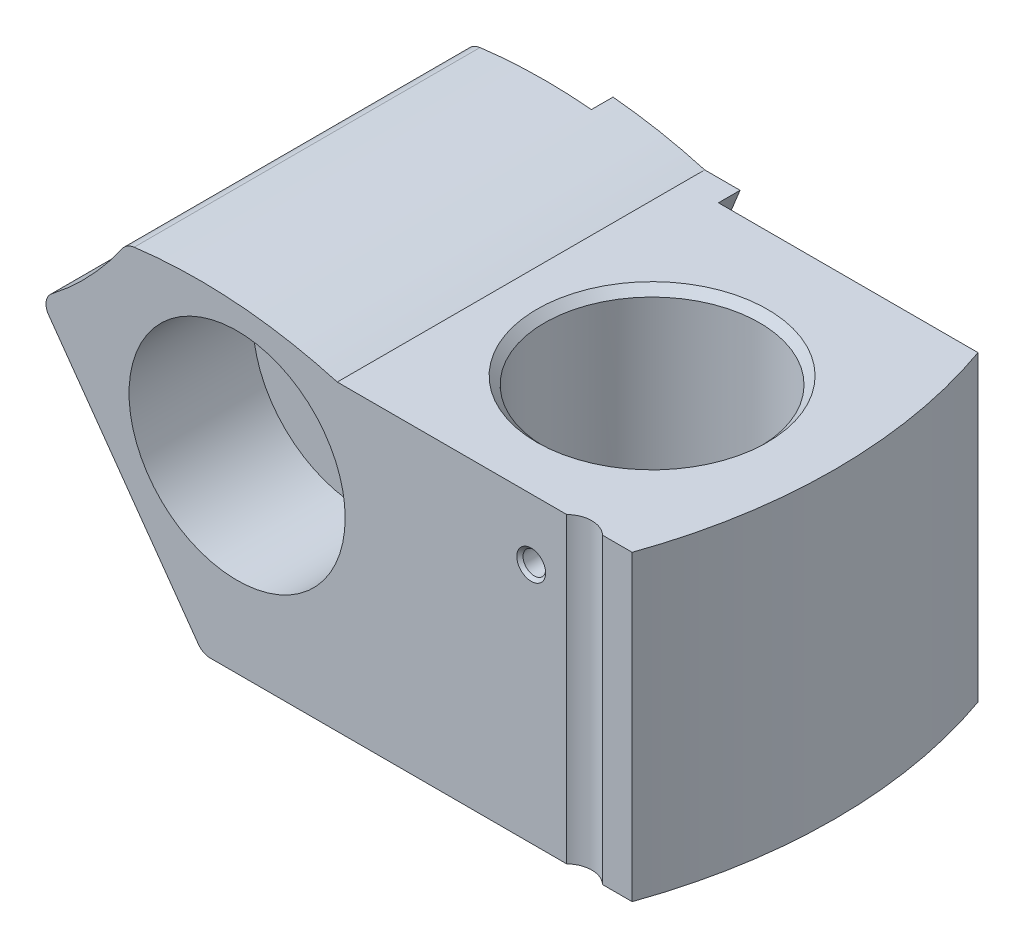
ISO-10303-21;
HEADER;
FILE_DESCRIPTION(('STEP AP214'),'2;1');
FILE_NAME('part.step','',(''),(''),'','','');
FILE_SCHEMA(('AUTOMOTIVE_DESIGN { 1 0 10303 214 1 1 1 1 }'));
ENDSEC;
DATA;
#1=APPLICATION_CONTEXT('core data for automotive mechanical design processes');
#2=APPLICATION_PROTOCOL_DEFINITION('international standard','automotive_design',2000,#1);
#3=PRODUCT_CONTEXT('',#1,'mechanical');
#4=PRODUCT('Part','Part','',(#3));
#5=PRODUCT_RELATED_PRODUCT_CATEGORY('part','',(#4));
#6=PRODUCT_DEFINITION_FORMATION('','',#4);
#7=PRODUCT_DEFINITION_CONTEXT('part definition',#1,'design');
#8=PRODUCT_DEFINITION('design','',#6,#7);
#9=PRODUCT_DEFINITION_SHAPE('','',#8);
#10=(LENGTH_UNIT() NAMED_UNIT(*) SI_UNIT(.MILLI.,.METRE.));
#11=(NAMED_UNIT(*) PLANE_ANGLE_UNIT() SI_UNIT($,.RADIAN.));
#12=(NAMED_UNIT(*) SI_UNIT($,.STERADIAN.) SOLID_ANGLE_UNIT());
#13=UNCERTAINTY_MEASURE_WITH_UNIT(LENGTH_MEASURE(1.E-05),#10,'distance_accuracy_value','');
#14=(GEOMETRIC_REPRESENTATION_CONTEXT(3) GLOBAL_UNCERTAINTY_ASSIGNED_CONTEXT((#13)) GLOBAL_UNIT_ASSIGNED_CONTEXT((#10,
#11,#12)) REPRESENTATION_CONTEXT('',''));
#15=CARTESIAN_POINT('',(0.,0.,0.));
#16=DIRECTION('',(0.,0.,1.));
#17=DIRECTION('',(1.,0.,0.));
#18=AXIS2_PLACEMENT_3D('',#15,#16,#17);
#19=CARTESIAN_POINT('',(30.6164,7.896,-25.5));
#20=DIRECTION('',(0.,1.,0.));
#21=DIRECTION('',(0.,0.,1.));
#22=AXIS2_PLACEMENT_3D('',#19,#20,#21);
#23=PLANE('',#22);
#24=CARTESIAN_POINT('',(-6.52329999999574,7.896,-12.));
#25=DIRECTION('',(0.,1.,0.));
#26=DIRECTION('',(0.,0.,1.));
#27=AXIS2_PLACEMENT_3D('',#24,#25,#26);
#28=CIRCLE('',#27,35.9999999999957);
#29=CARTESIAN_POINT('',(27.417825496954,7.896,-24.));
#30=VERTEX_POINT('',#29);
#31=CARTESIAN_POINT('',(27.417825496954,7.896,0.));
#32=VERTEX_POINT('',#31);
#33=EDGE_CURVE('E193',#30,#32,#28,.F.);
#34=ORIENTED_EDGE('',*,*,#33,.F.);
#35=DIRECTION('',(1.,0.,0.));
#36=VECTOR('',#35,1.);
#37=CARTESIAN_POINT('',(30.6164,7.896,-24.));
#38=LINE('',#37,#36);
#39=CARTESIAN_POINT('',(9.40695711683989,7.89599999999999,-24.));
#40=VERTEX_POINT('',#39);
#41=EDGE_CURVE('E226',#40,#30,#38,.T.);
#42=ORIENTED_EDGE('',*,*,#41,.F.);
#43=DIRECTION('',(0.,0.,1.));
#44=VECTOR('',#43,1.);
#45=CARTESIAN_POINT('',(9.40695711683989,7.89599999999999,-25.5));
#46=LINE('',#45,#44);
#47=CARTESIAN_POINT('',(9.40695711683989,7.89599999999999,-25.5));
#48=VERTEX_POINT('',#47);
#49=EDGE_CURVE('E206',#48,#40,#46,.T.);
#50=ORIENTED_EDGE('',*,*,#49,.F.);
#51=DIRECTION('',(-1.,0.,0.));
#52=VECTOR('',#51,1.);
#53=CARTESIAN_POINT('',(30.6164,7.896,-25.5));
#54=LINE('',#53,#52);
#55=CARTESIAN_POINT('',(6.9522692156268,7.896,-25.5));
#56=VERTEX_POINT('',#55);
#57=EDGE_CURVE('E237',#48,#56,#54,.T.);
#58=ORIENTED_EDGE('',*,*,#57,.T.);
#59=DIRECTION('',(0.,0.,1.));
#60=VECTOR('',#59,1.);
#61=CARTESIAN_POINT('',(6.9522692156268,7.896,-25.5));
#62=LINE('',#61,#60);
#63=CARTESIAN_POINT('',(6.9522692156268,7.896,0.));
#64=VERTEX_POINT('',#63);
#65=EDGE_CURVE('E271',#56,#64,#62,.T.);
#66=ORIENTED_EDGE('',*,*,#65,.T.);
#67=DIRECTION('',(-1.,0.,0.));
#68=VECTOR('',#67,1.);
#69=CARTESIAN_POINT('',(30.6164,7.896,0.));
#70=LINE('',#69,#68);
#71=CARTESIAN_POINT('',(22.8728100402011,7.896,0.));
#72=VERTEX_POINT('',#71);
#73=EDGE_CURVE('E258',#72,#64,#70,.T.);
#74=ORIENTED_EDGE('',*,*,#73,.F.);
#75=CARTESIAN_POINT('',(24.1178,7.896,1.3));
#76=DIRECTION('',(0.,1.,0.));
#77=DIRECTION('',(0.,0.,1.));
#78=AXIS2_PLACEMENT_3D('',#75,#76,#77);
#79=CIRCLE('',#78,1.8);
#80=CARTESIAN_POINT('',(25.3627899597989,7.896,0.));
#81=VERTEX_POINT('',#80);
#82=EDGE_CURVE('E231',#81,#72,#79,.T.);
#83=ORIENTED_EDGE('',*,*,#82,.F.);
#84=EDGE_CURVE('E259',#32,#81,#70,.T.);
#85=ORIENTED_EDGE('',*,*,#84,.F.);
#86=EDGE_LOOP('',(#34,#42,#50,#58,#66,#74,#83,#85));
#87=FACE_BOUND('',#86,.T.);
#88=CARTESIAN_POINT('',(17.5,7.896,-11.3));
#89=DIRECTION('',(0.,1.,0.));
#90=DIRECTION('',(0.,0.,1.));
#91=AXIS2_PLACEMENT_3D('',#88,#89,#90);
#92=CIRCLE('',#91,8.);
#93=CARTESIAN_POINT('',(17.5,7.896,-3.3));
#94=VERTEX_POINT('',#93);
#95=EDGE_CURVE('E295',#94,#94,#92,.T.);
#96=ORIENTED_EDGE('',*,*,#95,.F.);
#97=EDGE_LOOP('',(#96));
#98=FACE_BOUND('',#97,.T.);
#99=ADVANCED_FACE('F33',(#87,#98),#23,.T.);
#100=CARTESIAN_POINT('',(-1.8681244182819,-13.104,-25.5));
#101=DIRECTION('',(0.,-1.,0.));
#102=DIRECTION('',(0.,0.,-1.));
#103=AXIS2_PLACEMENT_3D('',#100,#101,#102);
#104=PLANE('',#103);
#105=CARTESIAN_POINT('',(-6.52329999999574,-13.104,-12.));
#106=DIRECTION('',(0.,-1.,0.));
#107=DIRECTION('',(0.,0.,-1.));
#108=AXIS2_PLACEMENT_3D('',#105,#106,#107);
#109=CIRCLE('',#108,35.9999999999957);
#110=CARTESIAN_POINT('',(27.417825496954,-13.104,0.));
#111=VERTEX_POINT('',#110);
#112=CARTESIAN_POINT('',(27.417825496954,-13.104,-24.));
#113=VERTEX_POINT('',#112);
#114=EDGE_CURVE('E58',#111,#113,#109,.F.);
#115=ORIENTED_EDGE('',*,*,#114,.F.);
#116=DIRECTION('',(1.,0.,0.));
#117=VECTOR('',#116,1.);
#118=CARTESIAN_POINT('',(-1.8681244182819,-13.104,0.));
#119=LINE('',#118,#117);
#120=CARTESIAN_POINT('',(25.3627899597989,-13.104,0.));
#121=VERTEX_POINT('',#120);
#122=EDGE_CURVE('E254',#121,#111,#119,.T.);
#123=ORIENTED_EDGE('',*,*,#122,.F.);
#124=CARTESIAN_POINT('',(24.1178,-13.104,1.3));
#125=DIRECTION('',(0.,-1.,0.));
#126=DIRECTION('',(0.,0.,-1.));
#127=AXIS2_PLACEMENT_3D('',#124,#125,#126);
#128=CIRCLE('',#127,1.8);
#129=CARTESIAN_POINT('',(22.8728100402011,-13.104,0.));
#130=VERTEX_POINT('',#129);
#131=EDGE_CURVE('E229',#130,#121,#128,.T.);
#132=ORIENTED_EDGE('',*,*,#131,.F.);
#133=CARTESIAN_POINT('',(-1.8681244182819,-13.104,0.));
#134=VERTEX_POINT('',#133);
#135=EDGE_CURVE('E255',#134,#130,#119,.T.);
#136=ORIENTED_EDGE('',*,*,#135,.F.);
#137=DIRECTION('',(0.,0.,1.));
#138=VECTOR('',#137,1.);
#139=CARTESIAN_POINT('',(-1.8681244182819,-13.104,-25.5));
#140=LINE('',#139,#138);
#141=CARTESIAN_POINT('',(-1.8681244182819,-13.104,-24.));
#142=VERTEX_POINT('',#141);
#143=EDGE_CURVE('E273',#142,#134,#140,.T.);
#144=ORIENTED_EDGE('',*,*,#143,.F.);
#145=DIRECTION('',(-1.,0.,0.));
#146=VECTOR('',#145,1.);
#147=CARTESIAN_POINT('',(-1.8681244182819,-13.104,-24.));
#148=LINE('',#147,#146);
#149=EDGE_CURVE('E224',#113,#142,#148,.T.);
#150=ORIENTED_EDGE('',*,*,#149,.F.);
#151=EDGE_LOOP('',(#115,#123,#132,#136,#144,#150));
#152=FACE_BOUND('',#151,.T.);
#153=CARTESIAN_POINT('',(17.5,-13.104,-11.3));
#154=DIRECTION('',(0.,-1.,0.));
#155=DIRECTION('',(0.,0.,-1.));
#156=AXIS2_PLACEMENT_3D('',#153,#154,#155);
#157=CIRCLE('',#156,7.99);
#158=CARTESIAN_POINT('',(17.5,-13.104,-19.29));
#159=VERTEX_POINT('',#158);
#160=EDGE_CURVE('E37',#159,#159,#157,.F.);
#161=ORIENTED_EDGE('',*,*,#160,.T.);
#162=EDGE_LOOP('',(#161));
#163=FACE_BOUND('',#162,.T.);
#164=ADVANCED_FACE('F321',(#152,#163),#104,.T.);
#165=CARTESIAN_POINT('',(20.4121,3.646,0.));
#166=DIRECTION('',(0.,0.,-1.));
#167=DIRECTION('',(-1.,0.,0.));
#168=AXIS2_PLACEMENT_3D('',#165,#166,#167);
#169=CYLINDRICAL_SURFACE('',#168,0.783499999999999);
#170=CARTESIAN_POINT('',(20.4121,3.646,-0.2165));
#171=DIRECTION('',(0.,0.,-1.));
#172=DIRECTION('',(-1.,0.,0.));
#173=AXIS2_PLACEMENT_3D('',#170,#171,#172);
#174=CIRCLE('',#173,0.783499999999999);
#175=CARTESIAN_POINT('',(19.6286,3.646,-0.2165));
#176=VERTEX_POINT('',#175);
#177=EDGE_CURVE('E182',#176,#176,#174,.T.);
#178=ORIENTED_EDGE('',*,*,#177,.F.);
#179=EDGE_LOOP('',(#178));
#180=FACE_BOUND('',#179,.T.);
#181=CARTESIAN_POINT('',(19.6286,3.646,-4.15169360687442));
#182=CARTESIAN_POINT('',(19.6286020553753,3.68851259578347,-4.15169387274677));
#183=CARTESIAN_POINT('',(19.6320740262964,3.73105649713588,-4.15272524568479));
#184=CARTESIAN_POINT('',(19.6458506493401,3.81495458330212,-4.15684965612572));
#185=CARTESIAN_POINT('',(19.656163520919,3.85630727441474,-4.15994517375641));
#186=CARTESIAN_POINT('',(19.6832453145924,3.9365761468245,-4.16817968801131));
#187=CARTESIAN_POINT('',(19.7000072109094,3.97549492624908,-4.17331646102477));
#188=CARTESIAN_POINT('',(19.7393978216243,4.04987530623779,-4.18559608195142));
#189=CARTESIAN_POINT('',(19.7620252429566,4.08533766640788,-4.19273848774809));
#190=CARTESIAN_POINT('',(19.8127179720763,4.1523615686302,-4.20907100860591));
#191=CARTESIAN_POINT('',(19.840851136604,4.18386542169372,-4.21828691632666));
#192=CARTESIAN_POINT('',(19.9014304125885,4.2416871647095,-4.23859975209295));
#193=CARTESIAN_POINT('',(19.9338772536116,4.26800417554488,-4.24969699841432));
#194=CARTESIAN_POINT('',(20.003410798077,4.31584673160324,-4.27407916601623));
#195=CARTESIAN_POINT('',(20.0406288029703,4.33714635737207,-4.28743233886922));
#196=CARTESIAN_POINT('',(20.1175094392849,4.37325088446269,-4.31576449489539));
#197=CARTESIAN_POINT('',(20.1571726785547,4.38805416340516,-4.33074388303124));
#198=CARTESIAN_POINT('',(20.2402355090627,4.41170702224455,-4.36296689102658));
#199=CARTESIAN_POINT('',(20.2837176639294,4.42015533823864,-4.38029185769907));
#200=CARTESIAN_POINT('',(20.3710270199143,4.429655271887,-4.41605820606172));
#201=CARTESIAN_POINT('',(20.4148543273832,4.43070451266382,-4.43449994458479));
#202=CARTESIAN_POINT('',(20.5046479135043,4.42539734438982,-4.47329820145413));
#203=CARTESIAN_POINT('',(20.5505654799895,4.4185497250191,-4.49370090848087));
#204=CARTESIAN_POINT('',(20.640418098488,4.39691960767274,-4.53468860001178));
#205=CARTESIAN_POINT('',(20.6843524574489,4.3821343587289,-4.55527364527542));
#206=CARTESIAN_POINT('',(20.7708317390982,4.34421265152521,-4.59677151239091));
#207=CARTESIAN_POINT('',(20.8132508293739,4.32076585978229,-4.61766451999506));
#208=CARTESIAN_POINT('',(20.8935044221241,4.26606433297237,-4.65805977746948));
#209=CARTESIAN_POINT('',(20.9313384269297,4.23480875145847,-4.67756187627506));
#210=CARTESIAN_POINT('',(21.0000119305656,4.16611384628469,-4.71360500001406));
#211=CARTESIAN_POINT('',(21.0310286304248,4.1288905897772,-4.73021784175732));
#212=CARTESIAN_POINT('',(21.086108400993,4.04843581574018,-4.76011971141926));
#213=CARTESIAN_POINT('',(21.1101782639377,4.00521022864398,-4.77341198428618));
#214=CARTESIAN_POINT('',(21.1477754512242,3.91914247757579,-4.7943586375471));
#215=CARTESIAN_POINT('',(21.1621807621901,3.87679806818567,-4.80247728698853));
#216=CARTESIAN_POINT('',(21.1836041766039,3.78972601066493,-4.81459805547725));
#217=CARTESIAN_POINT('',(21.1906299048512,3.74500087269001,-4.81860442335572));
#218=CARTESIAN_POINT('',(21.1964802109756,3.66026673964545,-4.82193980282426));
#219=CARTESIAN_POINT('',(21.1961877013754,3.62033579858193,-4.82177237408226));
#220=CARTESIAN_POINT('',(21.1895675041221,3.5411485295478,-4.81799965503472));
#221=CARTESIAN_POINT('',(21.1832408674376,3.50189208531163,-4.81439496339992));
#222=CARTESIAN_POINT('',(21.1651714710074,3.42642230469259,-4.80416731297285));
#223=CARTESIAN_POINT('',(21.1536078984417,3.3901518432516,-4.79764429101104));
#224=CARTESIAN_POINT('',(21.1256213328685,3.32014467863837,-4.78199815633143));
#225=CARTESIAN_POINT('',(21.1091973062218,3.28640851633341,-4.77287449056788));
#226=CARTESIAN_POINT('',(21.0707707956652,3.21985068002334,-4.7517689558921));
#227=CARTESIAN_POINT('',(21.0484586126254,3.18725778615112,-4.73963187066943));
#228=CARTESIAN_POINT('',(20.999664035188,3.12622172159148,-4.71347282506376));
#229=CARTESIAN_POINT('',(20.9731797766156,3.09778041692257,-4.69945002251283));
#230=CARTESIAN_POINT('',(20.9133635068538,3.04229222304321,-4.66830057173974));
#231=CARTESIAN_POINT('',(20.8795915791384,3.01581519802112,-4.65100317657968));
#232=CARTESIAN_POINT('',(20.8085812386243,2.96888224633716,-4.61538390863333));
#233=CARTESIAN_POINT('',(20.7713411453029,2.94842925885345,-4.59706154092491));
#234=CARTESIAN_POINT('',(20.6902954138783,2.91207432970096,-4.55808218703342));
#235=CARTESIAN_POINT('',(20.646207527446,2.89684931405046,-4.53737768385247));
#236=CARTESIAN_POINT('',(20.5559591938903,2.87441725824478,-4.49611882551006));
#237=CARTESIAN_POINT('',(20.5097981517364,2.86721253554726,-4.47556451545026));
#238=CARTESIAN_POINT('',(20.4149916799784,2.86101856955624,-4.43452104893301));
#239=CARTESIAN_POINT('',(20.3663152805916,2.86231878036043,-4.41405817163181));
#240=CARTESIAN_POINT('',(20.2694808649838,2.87404855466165,-4.37454469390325));
#241=CARTESIAN_POINT('',(20.2213227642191,2.88447660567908,-4.35549386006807));
#242=CARTESIAN_POINT('',(20.1289026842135,2.91392356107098,-4.31999609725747));
#243=CARTESIAN_POINT('',(20.0845624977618,2.93261090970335,-4.30347897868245));
#244=CARTESIAN_POINT('',(19.9994883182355,2.97820547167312,-4.27263724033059));
#245=CARTESIAN_POINT('',(19.9587526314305,3.0051087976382,-4.25831158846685));
#246=CARTESIAN_POINT('',(19.8851475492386,3.06438870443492,-4.23305534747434));
#247=CARTESIAN_POINT('',(19.8519301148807,3.09626276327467,-4.2219592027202));
#248=CARTESIAN_POINT('',(19.7913118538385,3.16577261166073,-4.2021036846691));
#249=CARTESIAN_POINT('',(19.7639104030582,3.20340778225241,-4.19334406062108));
#250=CARTESIAN_POINT('',(19.7174624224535,3.28093423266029,-4.17871903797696));
#251=CARTESIAN_POINT('',(19.6980186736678,3.3205618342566,-4.17271349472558));
#252=CARTESIAN_POINT('',(19.6660259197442,3.40272452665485,-4.16292518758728));
#253=CARTESIAN_POINT('',(19.6534665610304,3.44525514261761,-4.15913908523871));
#254=CARTESIAN_POINT('',(19.639274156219,3.51442618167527,-4.15487884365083));
#255=CARTESIAN_POINT('',(19.6352775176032,3.54056204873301,-4.15368486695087));
#256=CARTESIAN_POINT('',(19.6299398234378,3.59312791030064,-4.15209217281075));
#257=CARTESIAN_POINT('',(19.628598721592,3.61955789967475,-4.15169344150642));
#258=CARTESIAN_POINT('',(19.6286,3.646,-4.15169360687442));
#259=B_SPLINE_CURVE_WITH_KNOTS('',3,(#181,#182,#183,#184,#185,#186,#187,#188,#189,#190,#191,
#192,#193,#194,#195,#196,#197,#198,#199,#200,#201,#202,#203,#204,#205,#206,#207,#208,#209,#210,
#211,#212,#213,#214,#215,#216,#217,#218,#219,#220,#221,#222,#223,#224,#225,#226,#227,#228,#229,
#230,#231,#232,#233,#234,#235,#236,#237,#238,#239,#240,#241,#242,#243,#244,#245,#246,#247,#248,
#249,#250,#251,#252,#253,#254,#255,#256,#257,#258),.UNSPECIFIED.,.T.,.F.,(4,2,2,2,2,2,2,2,2,2,2,
2,2,2,2,2,2,2,2,2,2,2,2,2,2,2,2,2,2,2,2,2,2,2,2,2,2,2,4),(0.,0.127439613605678,
0.255032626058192,0.382487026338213,0.509913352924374,0.639022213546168,0.768152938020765,
0.902301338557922,1.03648322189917,1.17855508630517,1.32067258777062,1.47212965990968,
1.62363925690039,1.78120800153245,1.93879383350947,2.09160473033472,2.24426570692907,
2.37985368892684,2.51530143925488,2.63449660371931,2.75367101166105,2.8690442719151,
2.98444208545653,3.10790666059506,3.23142655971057,3.36966304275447,3.50796686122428,
3.66037650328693,3.81283017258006,3.97049876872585,4.1281412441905,4.27996074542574,
4.43170852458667,4.57303894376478,4.71435418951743,4.84734112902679,4.98012751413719,
5.05939413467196,5.13865937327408),.UNSPECIFIED.);
#260=CARTESIAN_POINT('',(19.6286,3.646,-4.15169360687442));
#261=VERTEX_POINT('',#260);
#262=EDGE_CURVE('E289',#261,#261,#259,.T.);
#263=ORIENTED_EDGE('',*,*,#262,.T.);
#264=EDGE_LOOP('',(#263));
#265=FACE_BOUND('',#264,.T.);
#266=ADVANCED_FACE('F296',(#180,#265),#169,.F.);
#267=CARTESIAN_POINT('',(-27.279800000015,21.8475000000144,0.));
#268=DIRECTION('',(0.,0.,-1.));
#269=DIRECTION('',(-1.,0.,0.));
#270=AXIS2_PLACEMENT_3D('',#267,#268,#269);
#271=PLANE('',#270);
#272=CARTESIAN_POINT('',(0.,0.,0.));
#273=DIRECTION('',(0.,0.,1.));
#274=DIRECTION('',(1.,0.,0.));
#275=AXIS2_PLACEMENT_3D('',#272,#273,#274);
#276=CIRCLE('',#275,7.5);
#277=CARTESIAN_POINT('',(7.5,0.,0.));
#278=VERTEX_POINT('',#277);
#279=EDGE_CURVE('E423',#278,#278,#276,.T.);
#280=ORIENTED_EDGE('',*,*,#279,.F.);
#281=EDGE_LOOP('',(#280));
#282=FACE_BOUND('',#281,.T.);
#283=ORIENTED_EDGE('',*,*,#135,.T.);
#284=DIRECTION('',(0.,1.,0.));
#285=VECTOR('',#284,1.);
#286=CARTESIAN_POINT('',(22.8728100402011,-15.,0.));
#287=LINE('',#286,#285);
#288=EDGE_CURVE('E282',#130,#72,#287,.T.);
#289=ORIENTED_EDGE('',*,*,#288,.T.);
#290=ORIENTED_EDGE('',*,*,#73,.T.);
#291=CARTESIAN_POINT('',(-2.65469999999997,-25.7597000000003,0.));
#292=DIRECTION('',(0.,0.,1.));
#293=DIRECTION('',(1.,0.,0.));
#294=AXIS2_PLACEMENT_3D('',#291,#292,#293);
#295=CIRCLE('',#294,35.0000000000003);
#296=CARTESIAN_POINT('',(-7.1442578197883,8.9511609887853,0.));
#297=VERTEX_POINT('',#296);
#298=EDGE_CURVE('E261',#64,#297,#295,.T.);
#299=ORIENTED_EDGE('',*,*,#298,.T.);
#300=CARTESIAN_POINT('',(-6.9903294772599,7.76107440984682,0.));
#301=DIRECTION('',(0.,0.,1.));
#302=DIRECTION('',(1.,0.,0.));
#303=AXIS2_PLACEMENT_3D('',#300,#301,#302);
#304=CIRCLE('',#303,1.20000000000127);
#305=CARTESIAN_POINT('',(-7.9760527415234,8.4454351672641,0.));
#306=VERTEX_POINT('',#305);
#307=EDGE_CURVE('E238',#297,#306,#304,.T.);
#308=ORIENTED_EDGE('',*,*,#307,.T.);
#309=CARTESIAN_POINT('',(-27.279800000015,21.8475000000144,0.));
#310=DIRECTION('',(0.,0.,-1.));
#311=DIRECTION('',(-1.,0.,0.));
#312=AXIS2_PLACEMENT_3D('',#309,#310,#311);
#313=CIRCLE('',#312,23.5000000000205);
#314=CARTESIAN_POINT('',(-12.875283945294,3.2797883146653,0.));
#315=VERTEX_POINT('',#314);
#316=EDGE_CURVE('E233',#306,#315,#313,.T.);
#317=ORIENTED_EDGE('',*,*,#316,.T.);
#318=CARTESIAN_POINT('',(-12.2623258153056,2.48967292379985,0.));
#319=DIRECTION('',(0.,0.,1.));
#320=DIRECTION('',(1.,0.,0.));
#321=AXIS2_PLACEMENT_3D('',#318,#319,#320);
#322=CIRCLE('',#321,1.00000000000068);
#323=CARTESIAN_POINT('',(-13.076846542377,1.9095384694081,0.));
#324=VERTEX_POINT('',#323);
#325=EDGE_CURVE('E245',#315,#324,#322,.T.);
#326=ORIENTED_EDGE('',*,*,#325,.T.);
#327=DIRECTION('',(0.580134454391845,-0.814520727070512,0.));
#328=VECTOR('',#327,1.);
#329=CARTESIAN_POINT('',(-13.076846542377,1.9095384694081,0.));
#330=LINE('',#329,#328);
#331=CARTESIAN_POINT('',(-2.6826451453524,-12.684134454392,0.));
#332=VERTEX_POINT('',#331);
#333=EDGE_CURVE('E248',#324,#332,#330,.T.);
#334=ORIENTED_EDGE('',*,*,#333,.T.);
#335=CARTESIAN_POINT('',(-1.86812441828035,-12.1039999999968,0.));
#336=DIRECTION('',(0.,0.,1.));
#337=DIRECTION('',(1.,0.,0.));
#338=AXIS2_PLACEMENT_3D('',#335,#336,#337);
#339=CIRCLE('',#338,1.0000000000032);
#340=EDGE_CURVE('E251',#332,#134,#339,.T.);
#341=ORIENTED_EDGE('',*,*,#340,.T.);
#342=EDGE_LOOP('',(#283,#289,#290,#299,#308,#317,#326,#334,#341));
#343=FACE_BOUND('',#342,.T.);
#344=CARTESIAN_POINT('',(20.4121,3.646,0.));
#345=DIRECTION('',(0.,0.,-1.));
#346=DIRECTION('',(-1.,0.,0.));
#347=AXIS2_PLACEMENT_3D('',#344,#345,#346);
#348=CIRCLE('',#347,1.);
#349=CARTESIAN_POINT('',(19.4121,3.646,0.));
#350=VERTEX_POINT('',#349);
#351=EDGE_CURVE('E435',#350,#350,#348,.T.);
#352=ORIENTED_EDGE('',*,*,#351,.T.);
#353=EDGE_LOOP('',(#352));
#354=FACE_BOUND('',#353,.T.);
#355=ADVANCED_FACE('F352',(#282,#343,#354),#271,.F.);
#356=CARTESIAN_POINT('',(-27.279800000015,21.8475000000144,-25.5));
#357=DIRECTION('',(0.,0.,-1.));
#358=DIRECTION('',(-1.,0.,0.));
#359=AXIS2_PLACEMENT_3D('',#356,#357,#358);
#360=PLANE('',#359);
#361=CARTESIAN_POINT('',(-27.279800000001,21.8475000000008,-25.5));
#362=DIRECTION('',(0.,0.,1.));
#363=DIRECTION('',(1.,0.,0.));
#364=AXIS2_PLACEMENT_3D('',#361,#362,#363);
#365=CIRCLE('',#364,39.2500000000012);
#366=CARTESIAN_POINT('',(4.21532506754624,-1.57513001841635,-25.5));
#367=VERTEX_POINT('',#366);
#368=EDGE_CURVE('E181',#367,#48,#365,.T.);
#369=ORIENTED_EDGE('',*,*,#368,.F.);
#370=CARTESIAN_POINT('',(0.,0.,-25.5));
#371=DIRECTION('',(0.,0.,1.));
#372=DIRECTION('',(1.,0.,0.));
#373=AXIS2_PLACEMENT_3D('',#370,#371,#372);
#374=CIRCLE('',#373,4.5);
#375=CARTESIAN_POINT('',(-2.59945310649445,3.67326061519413,-25.5));
#376=VERTEX_POINT('',#375);
#377=EDGE_CURVE('E165',#367,#376,#374,.T.);
#378=ORIENTED_EDGE('',*,*,#377,.T.);
#379=CARTESIAN_POINT('',(-27.279800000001,21.8475000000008,-25.5));
#380=DIRECTION('',(0.,0.,-1.));
#381=DIRECTION('',(-1.,0.,0.));
#382=AXIS2_PLACEMENT_3D('',#379,#380,#381);
#383=CIRCLE('',#382,30.6500000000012);
#384=CARTESIAN_POINT('',(0.588831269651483,9.08968313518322,-25.5));
#385=VERTEX_POINT('',#384);
#386=EDGE_CURVE('E178',#385,#376,#383,.T.);
#387=ORIENTED_EDGE('',*,*,#386,.F.);
#388=CARTESIAN_POINT('',(-2.65469999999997,-25.7597000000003,-25.5));
#389=DIRECTION('',(0.,0.,1.));
#390=DIRECTION('',(1.,0.,0.));
#391=AXIS2_PLACEMENT_3D('',#388,#389,#390);
#392=CIRCLE('',#391,35.0000000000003);
#393=EDGE_CURVE('E240',#56,#385,#392,.T.);
#394=ORIENTED_EDGE('',*,*,#393,.F.);
#395=ORIENTED_EDGE('',*,*,#57,.F.);
#396=EDGE_LOOP('',(#369,#378,#387,#394,#395));
#397=FACE_BOUND('',#396,.T.);
#398=ADVANCED_FACE('F176',(#397),#360,.T.);
#399=CARTESIAN_POINT('',(-4.15244948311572,1.7341174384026,-25.5));
#400=VERTEX_POINT('',#399);
#401=CARTESIAN_POINT('',(-9.4971301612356,-3.1164570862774,-25.5));
#402=VERTEX_POINT('',#401);
#403=EDGE_CURVE('E187',#400,#402,#383,.T.);
#404=ORIENTED_EDGE('',*,*,#403,.F.);
#405=CARTESIAN_POINT('',(2.45804371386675,-3.7693528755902,-25.5));
#406=VERTEX_POINT('',#405);
#407=EDGE_CURVE('E50',#400,#406,#374,.T.);
#408=ORIENTED_EDGE('',*,*,#407,.T.);
#409=CARTESIAN_POINT('',(-4.50797384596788,-10.1213353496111,-25.5));
#410=VERTEX_POINT('',#409);
#411=EDGE_CURVE('E189',#410,#406,#365,.T.);
#412=ORIENTED_EDGE('',*,*,#411,.F.);
#413=DIRECTION('',(0.580134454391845,-0.814520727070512,0.));
#414=VECTOR('',#413,1.);
#415=CARTESIAN_POINT('',(-13.076846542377,1.9095384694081,-25.5));
#416=LINE('',#415,#414);
#417=EDGE_CURVE('E234',#402,#410,#416,.T.);
#418=ORIENTED_EDGE('',*,*,#417,.F.);
#419=EDGE_LOOP('',(#404,#408,#412,#418));
#420=FACE_BOUND('',#419,.T.);
#421=ADVANCED_FACE('F407',(#420),#360,.T.);
#422=CARTESIAN_POINT('',(-27.279800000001,21.8475000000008,-25.5));
#423=DIRECTION('',(0.,0.,1.));
#424=DIRECTION('',(1.,0.,0.));
#425=AXIS2_PLACEMENT_3D('',#422,#423,#424);
#426=CYLINDRICAL_SURFACE('',#425,39.2500000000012);
#427=CARTESIAN_POINT('',(-27.279800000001,21.8475000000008,-24.));
#428=DIRECTION('',(0.,0.,1.));
#429=DIRECTION('',(1.,0.,0.));
#430=AXIS2_PLACEMENT_3D('',#427,#428,#429);
#431=CIRCLE('',#430,39.2500000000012);
#432=CARTESIAN_POINT('',(4.21532506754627,-1.57513001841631,-24.));
#433=VERTEX_POINT('',#432);
#434=EDGE_CURVE('E200',#433,#40,#431,.T.);
#435=ORIENTED_EDGE('',*,*,#434,.F.);
#436=DIRECTION('',(0.,0.,1.));
#437=VECTOR('',#436,1.);
#438=CARTESIAN_POINT('',(4.21532506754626,-1.57513001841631,-17.05));
#439=LINE('',#438,#437);
#440=EDGE_CURVE('E389',#433,#367,#439,.F.);
#441=ORIENTED_EDGE('',*,*,#440,.T.);
#442=ORIENTED_EDGE('',*,*,#368,.T.);
#443=ORIENTED_EDGE('',*,*,#49,.T.);
#444=EDGE_LOOP('',(#435,#441,#442,#443));
#445=FACE_BOUND('',#444,.T.);
#446=ADVANCED_FACE('F388',(#445),#426,.T.);
#447=ORIENTED_EDGE('',*,*,#411,.T.);
#448=DIRECTION('',(0.,0.,1.));
#449=VECTOR('',#448,1.);
#450=CARTESIAN_POINT('',(2.45804371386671,-3.76935287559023,-17.05));
#451=LINE('',#450,#449);
#452=CARTESIAN_POINT('',(2.45804371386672,-3.76935287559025,-24.));
#453=VERTEX_POINT('',#452);
#454=EDGE_CURVE('E392',#406,#453,#451,.T.);
#455=ORIENTED_EDGE('',*,*,#454,.T.);
#456=CARTESIAN_POINT('',(-4.5079738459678,-10.121335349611,-24.));
#457=VERTEX_POINT('',#456);
#458=EDGE_CURVE('E191',#457,#453,#431,.T.);
#459=ORIENTED_EDGE('',*,*,#458,.F.);
#460=DIRECTION('',(0.,0.,1.));
#461=VECTOR('',#460,1.);
#462=CARTESIAN_POINT('',(-4.5079738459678,-10.121335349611,-25.5));
#463=LINE('',#462,#461);
#464=EDGE_CURVE('E209',#410,#457,#463,.T.);
#465=ORIENTED_EDGE('',*,*,#464,.F.);
#466=EDGE_LOOP('',(#447,#455,#459,#465));
#467=FACE_BOUND('',#466,.T.);
#468=ADVANCED_FACE('F409',(#467),#426,.T.);
#469=CARTESIAN_POINT('',(-15.,-15.,-24.));
#470=DIRECTION('',(0.,0.,1.));
#471=DIRECTION('',(1.,0.,0.));
#472=AXIS2_PLACEMENT_3D('',#469,#470,#471);
#473=PLANE('',#472);
#474=CARTESIAN_POINT('',(0.,0.,-24.));
#475=DIRECTION('',(0.,0.,1.));
#476=DIRECTION('',(1.,0.,0.));
#477=AXIS2_PLACEMENT_3D('',#474,#475,#476);
#478=CIRCLE('',#477,4.5);
#479=EDGE_CURVE('E397',#433,#453,#478,.F.);
#480=ORIENTED_EDGE('',*,*,#479,.F.);
#481=ORIENTED_EDGE('',*,*,#434,.T.);
#482=ORIENTED_EDGE('',*,*,#41,.T.);
#483=DIRECTION('',(0.,1.,0.));
#484=VECTOR('',#483,1.);
#485=CARTESIAN_POINT('',(27.417825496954,-15.,-24.));
#486=LINE('',#485,#484);
#487=EDGE_CURVE('E287',#30,#113,#486,.F.);
#488=ORIENTED_EDGE('',*,*,#487,.T.);
#489=ORIENTED_EDGE('',*,*,#149,.T.);
#490=CARTESIAN_POINT('',(-1.86812441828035,-12.1039999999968,-24.));
#491=DIRECTION('',(0.,0.,1.));
#492=DIRECTION('',(1.,0.,0.));
#493=AXIS2_PLACEMENT_3D('',#490,#491,#492);
#494=CIRCLE('',#493,1.0000000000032);
#495=CARTESIAN_POINT('',(-2.6826451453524,-12.684134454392,-24.));
#496=VERTEX_POINT('',#495);
#497=EDGE_CURVE('E222',#142,#496,#494,.F.);
#498=ORIENTED_EDGE('',*,*,#497,.T.);
#499=DIRECTION('',(-0.580134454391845,0.814520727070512,0.));
#500=VECTOR('',#499,1.);
#501=CARTESIAN_POINT('',(-13.076846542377,1.9095384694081,-24.));
#502=LINE('',#501,#500);
#503=EDGE_CURVE('E216',#496,#457,#502,.T.);
#504=ORIENTED_EDGE('',*,*,#503,.T.);
#505=ORIENTED_EDGE('',*,*,#458,.T.);
#506=EDGE_LOOP('',(#480,#481,#482,#488,#489,#498,#504,#505));
#507=FACE_BOUND('',#506,.T.);
#508=ADVANCED_FACE('F422',(#507),#473,.F.);
#509=CARTESIAN_POINT('',(0.,0.,-24.));
#510=DIRECTION('',(0.,0.,1.));
#511=DIRECTION('',(1.,0.,0.));
#512=AXIS2_PLACEMENT_3D('',#509,#510,#511);
#513=CIRCLE('',#512,4.5);
#514=CARTESIAN_POINT('',(-4.15244948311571,1.73411743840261,-24.));
#515=VERTEX_POINT('',#514);
#516=CARTESIAN_POINT('',(-2.59945310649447,3.6732606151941,-24.));
#517=VERTEX_POINT('',#516);
#518=EDGE_CURVE('E168',#515,#517,#513,.F.);
#519=ORIENTED_EDGE('',*,*,#518,.F.);
#520=CARTESIAN_POINT('',(-27.279800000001,21.8475000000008,-24.));
#521=DIRECTION('',(0.,0.,-1.));
#522=DIRECTION('',(-1.,0.,0.));
#523=AXIS2_PLACEMENT_3D('',#520,#521,#522);
#524=CIRCLE('',#523,30.6500000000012);
#525=CARTESIAN_POINT('',(-9.4971301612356,-3.1164570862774,-24.));
#526=VERTEX_POINT('',#525);
#527=EDGE_CURVE('E201',#515,#526,#524,.T.);
#528=ORIENTED_EDGE('',*,*,#527,.T.);
#529=CARTESIAN_POINT('',(-13.076846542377,1.9095384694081,-24.));
#530=VERTEX_POINT('',#529);
#531=EDGE_CURVE('E205',#526,#530,#502,.T.);
#532=ORIENTED_EDGE('',*,*,#531,.T.);
#533=CARTESIAN_POINT('',(-12.2623258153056,2.48967292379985,-24.));
#534=DIRECTION('',(0.,0.,1.));
#535=DIRECTION('',(1.,0.,0.));
#536=AXIS2_PLACEMENT_3D('',#533,#534,#535);
#537=CIRCLE('',#536,1.00000000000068);
#538=CARTESIAN_POINT('',(-12.875283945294,3.2797883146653,-24.));
#539=VERTEX_POINT('',#538);
#540=EDGE_CURVE('E285',#530,#539,#537,.F.);
#541=ORIENTED_EDGE('',*,*,#540,.T.);
#542=CARTESIAN_POINT('',(-27.279800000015,21.8475000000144,-24.));
#543=DIRECTION('',(0.,0.,1.));
#544=DIRECTION('',(1.,0.,0.));
#545=AXIS2_PLACEMENT_3D('',#542,#543,#544);
#546=CIRCLE('',#545,23.5000000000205);
#547=CARTESIAN_POINT('',(-7.9760527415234,8.4454351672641,-24.));
#548=VERTEX_POINT('',#547);
#549=EDGE_CURVE('E215',#539,#548,#546,.T.);
#550=ORIENTED_EDGE('',*,*,#549,.T.);
#551=CARTESIAN_POINT('',(-6.9903294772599,7.76107440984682,-24.));
#552=DIRECTION('',(0.,0.,1.));
#553=DIRECTION('',(1.,0.,0.));
#554=AXIS2_PLACEMENT_3D('',#551,#552,#553);
#555=CIRCLE('',#554,1.20000000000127);
#556=CARTESIAN_POINT('',(-7.1442578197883,8.9511609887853,-24.));
#557=VERTEX_POINT('',#556);
#558=EDGE_CURVE('E218',#548,#557,#555,.F.);
#559=ORIENTED_EDGE('',*,*,#558,.T.);
#560=CARTESIAN_POINT('',(-2.65469999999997,-25.7597000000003,-24.));
#561=DIRECTION('',(0.,0.,1.));
#562=DIRECTION('',(1.,0.,0.));
#563=AXIS2_PLACEMENT_3D('',#560,#561,#562);
#564=CIRCLE('',#563,35.0000000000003);
#565=CARTESIAN_POINT('',(0.58883126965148,9.0896831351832,-24.));
#566=VERTEX_POINT('',#565);
#567=EDGE_CURVE('E220',#557,#566,#564,.F.);
#568=ORIENTED_EDGE('',*,*,#567,.T.);
#569=EDGE_CURVE('E198',#566,#517,#524,.T.);
#570=ORIENTED_EDGE('',*,*,#569,.T.);
#571=EDGE_LOOP('',(#519,#528,#532,#541,#550,#559,#568,#570));
#572=FACE_BOUND('',#571,.T.);
#573=ADVANCED_FACE('F372',(#572),#473,.F.);
#574=CARTESIAN_POINT('',(-27.279800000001,21.8475000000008,-25.5));
#575=DIRECTION('',(0.,0.,1.));
#576=DIRECTION('',(1.,0.,0.));
#577=AXIS2_PLACEMENT_3D('',#574,#575,#576);
#578=CYLINDRICAL_SURFACE('',#577,30.6500000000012);
#579=ORIENTED_EDGE('',*,*,#386,.T.);
#580=DIRECTION('',(0.,0.,1.));
#581=VECTOR('',#580,1.);
#582=CARTESIAN_POINT('',(-2.59945310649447,3.67326061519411,-17.05));
#583=LINE('',#582,#581);
#584=EDGE_CURVE('E11',#376,#517,#583,.T.);
#585=ORIENTED_EDGE('',*,*,#584,.T.);
#586=ORIENTED_EDGE('',*,*,#569,.F.);
#587=DIRECTION('',(0.,0.,1.));
#588=VECTOR('',#587,1.);
#589=CARTESIAN_POINT('',(0.58883126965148,9.0896831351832,-25.5));
#590=LINE('',#589,#588);
#591=EDGE_CURVE('E186',#385,#566,#590,.T.);
#592=ORIENTED_EDGE('',*,*,#591,.F.);
#593=EDGE_LOOP('',(#579,#585,#586,#592));
#594=FACE_BOUND('',#593,.T.);
#595=ADVANCED_FACE('F184',(#594),#578,.F.);
#596=ORIENTED_EDGE('',*,*,#527,.F.);
#597=DIRECTION('',(0.,0.,1.));
#598=VECTOR('',#597,1.);
#599=CARTESIAN_POINT('',(-4.15244948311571,1.73411743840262,-17.05));
#600=LINE('',#599,#598);
#601=EDGE_CURVE('E42',#515,#400,#600,.F.);
#602=ORIENTED_EDGE('',*,*,#601,.T.);
#603=ORIENTED_EDGE('',*,*,#403,.T.);
#604=DIRECTION('',(0.,0.,1.));
#605=VECTOR('',#604,1.);
#606=CARTESIAN_POINT('',(-9.4971301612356,-3.1164570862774,-25.5));
#607=LINE('',#606,#605);
#608=EDGE_CURVE('E197',#402,#526,#607,.T.);
#609=ORIENTED_EDGE('',*,*,#608,.T.);
#610=EDGE_LOOP('',(#596,#602,#603,#609));
#611=FACE_BOUND('',#610,.T.);
#612=ADVANCED_FACE('F402',(#611),#578,.F.);
#613=CARTESIAN_POINT('',(-27.279800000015,21.8475000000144,-25.5));
#614=DIRECTION('',(0.,0.,1.));
#615=DIRECTION('',(1.,0.,0.));
#616=AXIS2_PLACEMENT_3D('',#613,#614,#615);
#617=CYLINDRICAL_SURFACE('',#616,23.5000000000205);
#618=ORIENTED_EDGE('',*,*,#549,.F.);
#619=DIRECTION('',(0.,0.,1.));
#620=VECTOR('',#619,1.);
#621=CARTESIAN_POINT('',(-12.875283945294,3.2797883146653,-25.5));
#622=LINE('',#621,#620);
#623=EDGE_CURVE('E242',#539,#315,#622,.T.);
#624=ORIENTED_EDGE('',*,*,#623,.T.);
#625=ORIENTED_EDGE('',*,*,#316,.F.);
#626=DIRECTION('',(0.,0.,1.));
#627=VECTOR('',#626,1.);
#628=CARTESIAN_POINT('',(-7.9760527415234,8.4454351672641,-25.5));
#629=LINE('',#628,#627);
#630=EDGE_CURVE('E266',#548,#306,#629,.T.);
#631=ORIENTED_EDGE('',*,*,#630,.F.);
#632=EDGE_LOOP('',(#618,#624,#625,#631));
#633=FACE_BOUND('',#632,.T.);
#634=ADVANCED_FACE('F35',(#633),#617,.F.);
#635=CARTESIAN_POINT('',(-6.9903294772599,7.76107440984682,-25.5));
#636=DIRECTION('',(0.,0.,1.));
#637=DIRECTION('',(1.,0.,0.));
#638=AXIS2_PLACEMENT_3D('',#635,#636,#637);
#639=CYLINDRICAL_SURFACE('',#638,1.20000000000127);
#640=ORIENTED_EDGE('',*,*,#558,.F.);
#641=ORIENTED_EDGE('',*,*,#630,.T.);
#642=ORIENTED_EDGE('',*,*,#307,.F.);
#643=DIRECTION('',(0.,0.,1.));
#644=VECTOR('',#643,1.);
#645=CARTESIAN_POINT('',(-7.1442578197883,8.9511609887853,-25.5));
#646=LINE('',#645,#644);
#647=EDGE_CURVE('E269',#557,#297,#646,.T.);
#648=ORIENTED_EDGE('',*,*,#647,.F.);
#649=EDGE_LOOP('',(#640,#641,#642,#648));
#650=FACE_BOUND('',#649,.T.);
#651=ADVANCED_FACE('F376',(#650),#639,.T.);
#652=CARTESIAN_POINT('',(-2.65469999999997,-25.7597000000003,-25.5));
#653=DIRECTION('',(0.,0.,1.));
#654=DIRECTION('',(1.,0.,0.));
#655=AXIS2_PLACEMENT_3D('',#652,#653,#654);
#656=CYLINDRICAL_SURFACE('',#655,35.0000000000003);
#657=ORIENTED_EDGE('',*,*,#567,.F.);
#658=ORIENTED_EDGE('',*,*,#647,.T.);
#659=ORIENTED_EDGE('',*,*,#298,.F.);
#660=ORIENTED_EDGE('',*,*,#65,.F.);
#661=ORIENTED_EDGE('',*,*,#393,.T.);
#662=ORIENTED_EDGE('',*,*,#591,.T.);
#663=EDGE_LOOP('',(#657,#658,#659,#660,#661,#662));
#664=FACE_BOUND('',#663,.T.);
#665=ADVANCED_FACE('F332',(#664),#656,.T.);
#666=CARTESIAN_POINT('',(-1.86812441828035,-12.1039999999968,-25.5));
#667=DIRECTION('',(0.,0.,1.));
#668=DIRECTION('',(1.,0.,0.));
#669=AXIS2_PLACEMENT_3D('',#666,#667,#668);
#670=CYLINDRICAL_SURFACE('',#669,1.0000000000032);
#671=ORIENTED_EDGE('',*,*,#497,.F.);
#672=ORIENTED_EDGE('',*,*,#143,.T.);
#673=ORIENTED_EDGE('',*,*,#340,.F.);
#674=DIRECTION('',(0.,0.,1.));
#675=VECTOR('',#674,1.);
#676=CARTESIAN_POINT('',(-2.6826451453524,-12.684134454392,-25.5));
#677=LINE('',#676,#675);
#678=EDGE_CURVE('E275',#496,#332,#677,.T.);
#679=ORIENTED_EDGE('',*,*,#678,.F.);
#680=EDGE_LOOP('',(#671,#672,#673,#679));
#681=FACE_BOUND('',#680,.T.);
#682=ADVANCED_FACE('F335',(#681),#670,.T.);
#683=CARTESIAN_POINT('',(-13.076846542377,1.9095384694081,-25.5));
#684=DIRECTION('',(-0.814520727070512,-0.580134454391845,0.));
#685=DIRECTION('',(0.580134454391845,-0.814520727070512,0.));
#686=AXIS2_PLACEMENT_3D('',#683,#684,#685);
#687=PLANE('',#686);
#688=ORIENTED_EDGE('',*,*,#503,.F.);
#689=ORIENTED_EDGE('',*,*,#678,.T.);
#690=ORIENTED_EDGE('',*,*,#333,.F.);
#691=DIRECTION('',(0.,0.,1.));
#692=VECTOR('',#691,1.);
#693=CARTESIAN_POINT('',(-13.076846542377,1.9095384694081,-25.5));
#694=LINE('',#693,#692);
#695=EDGE_CURVE('E277',#530,#324,#694,.T.);
#696=ORIENTED_EDGE('',*,*,#695,.F.);
#697=ORIENTED_EDGE('',*,*,#531,.F.);
#698=ORIENTED_EDGE('',*,*,#608,.F.);
#699=ORIENTED_EDGE('',*,*,#417,.T.);
#700=ORIENTED_EDGE('',*,*,#464,.T.);
#701=EDGE_LOOP('',(#688,#689,#690,#696,#697,#698,#699,#700));
#702=FACE_BOUND('',#701,.T.);
#703=ADVANCED_FACE('F338',(#702),#687,.T.);
#704=CARTESIAN_POINT('',(-12.2623258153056,2.48967292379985,-25.5));
#705=DIRECTION('',(0.,0.,1.));
#706=DIRECTION('',(1.,0.,0.));
#707=AXIS2_PLACEMENT_3D('',#704,#705,#706);
#708=CYLINDRICAL_SURFACE('',#707,1.00000000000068);
#709=ORIENTED_EDGE('',*,*,#540,.F.);
#710=ORIENTED_EDGE('',*,*,#695,.T.);
#711=ORIENTED_EDGE('',*,*,#325,.F.);
#712=ORIENTED_EDGE('',*,*,#623,.F.);
#713=EDGE_LOOP('',(#709,#710,#711,#712));
#714=FACE_BOUND('',#713,.T.);
#715=ADVANCED_FACE('F341',(#714),#708,.T.);
#716=ORIENTED_EDGE('',*,*,#122,.T.);
#717=DIRECTION('',(0.,1.,0.));
#718=VECTOR('',#717,1.);
#719=CARTESIAN_POINT('',(27.417825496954,-15.,0.));
#720=LINE('',#719,#718);
#721=EDGE_CURVE('E391',#111,#32,#720,.T.);
#722=ORIENTED_EDGE('',*,*,#721,.T.);
#723=ORIENTED_EDGE('',*,*,#84,.T.);
#724=DIRECTION('',(0.,1.,0.));
#725=VECTOR('',#724,1.);
#726=CARTESIAN_POINT('',(25.3627899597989,-15.,0.));
#727=LINE('',#726,#725);
#728=EDGE_CURVE('E268',#81,#121,#727,.F.);
#729=ORIENTED_EDGE('',*,*,#728,.T.);
#730=EDGE_LOOP('',(#716,#722,#723,#729));
#731=FACE_BOUND('',#730,.T.);
#732=ADVANCED_FACE('F344',(#731),#271,.F.);
#733=CARTESIAN_POINT('',(24.1178,-15.,1.3));
#734=DIRECTION('',(0.,1.,0.));
#735=DIRECTION('',(0.,0.,1.));
#736=AXIS2_PLACEMENT_3D('',#733,#734,#735);
#737=CYLINDRICAL_SURFACE('',#736,1.8);
#738=ORIENTED_EDGE('',*,*,#131,.T.);
#739=ORIENTED_EDGE('',*,*,#728,.F.);
#740=ORIENTED_EDGE('',*,*,#82,.T.);
#741=ORIENTED_EDGE('',*,*,#288,.F.);
#742=EDGE_LOOP('',(#738,#739,#740,#741));
#743=FACE_BOUND('',#742,.T.);
#744=ADVANCED_FACE('F349',(#743),#737,.F.);
#745=CARTESIAN_POINT('',(-6.52329999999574,-15.,-12.));
#746=DIRECTION('',(0.,1.,0.));
#747=DIRECTION('',(0.,0.,1.));
#748=AXIS2_PLACEMENT_3D('',#745,#746,#747);
#749=CYLINDRICAL_SURFACE('',#748,35.9999999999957);
#750=ORIENTED_EDGE('',*,*,#33,.T.);
#751=ORIENTED_EDGE('',*,*,#721,.F.);
#752=ORIENTED_EDGE('',*,*,#114,.T.);
#753=ORIENTED_EDGE('',*,*,#487,.F.);
#754=EDGE_LOOP('',(#750,#751,#752,#753));
#755=FACE_BOUND('',#754,.T.);
#756=ADVANCED_FACE('F519',(#755),#749,.T.);
#757=CARTESIAN_POINT('',(0.,0.,-25.5));
#758=DIRECTION('',(0.,0.,1.));
#759=DIRECTION('',(1.,0.,0.));
#760=AXIS2_PLACEMENT_3D('',#757,#758,#759);
#761=CYLINDRICAL_SURFACE('',#760,7.5);
#762=ORIENTED_EDGE('',*,*,#279,.T.);
#763=EDGE_LOOP('',(#762));
#764=FACE_BOUND('',#763,.T.);
#765=CARTESIAN_POINT('',(0.,0.,-8.6));
#766=DIRECTION('',(0.,0.,1.));
#767=DIRECTION('',(1.,0.,0.));
#768=AXIS2_PLACEMENT_3D('',#765,#766,#767);
#769=CIRCLE('',#768,7.5);
#770=CARTESIAN_POINT('',(7.5,0.,-8.6));
#771=VERTEX_POINT('',#770);
#772=EDGE_CURVE('E428',#771,#771,#769,.T.);
#773=ORIENTED_EDGE('',*,*,#772,.F.);
#774=EDGE_LOOP('',(#773));
#775=FACE_BOUND('',#774,.T.);
#776=ADVANCED_FACE('F509',(#764,#775),#761,.F.);
#777=CARTESIAN_POINT('',(0.,7.5,-8.6));
#778=DIRECTION('',(0.,0.,1.));
#779=DIRECTION('',(1.,0.,0.));
#780=AXIS2_PLACEMENT_3D('',#777,#778,#779);
#781=PLANE('',#780);
#782=ORIENTED_EDGE('',*,*,#772,.T.);
#783=EDGE_LOOP('',(#782));
#784=FACE_BOUND('',#783,.T.);
#785=CARTESIAN_POINT('',(0.,0.,-8.6));
#786=DIRECTION('',(0.,0.,1.));
#787=DIRECTION('',(1.,0.,0.));
#788=AXIS2_PLACEMENT_3D('',#785,#786,#787);
#789=CIRCLE('',#788,4.5);
#790=CARTESIAN_POINT('',(4.5,0.,-8.6));
#791=VERTEX_POINT('',#790);
#792=EDGE_CURVE('E431',#791,#791,#789,.T.);
#793=ORIENTED_EDGE('',*,*,#792,.F.);
#794=EDGE_LOOP('',(#793));
#795=FACE_BOUND('',#794,.T.);
#796=ADVANCED_FACE('F316',(#784,#795),#781,.T.);
#797=CARTESIAN_POINT('',(0.,0.,-25.5));
#798=DIRECTION('',(0.,0.,1.));
#799=DIRECTION('',(1.,0.,0.));
#800=AXIS2_PLACEMENT_3D('',#797,#798,#799);
#801=CYLINDRICAL_SURFACE('',#800,4.5);
#802=ORIENTED_EDGE('',*,*,#792,.T.);
#803=EDGE_LOOP('',(#802));
#804=FACE_BOUND('',#803,.T.);
#805=ORIENTED_EDGE('',*,*,#479,.T.);
#806=ORIENTED_EDGE('',*,*,#454,.F.);
#807=ORIENTED_EDGE('',*,*,#407,.F.);
#808=ORIENTED_EDGE('',*,*,#601,.F.);
#809=ORIENTED_EDGE('',*,*,#518,.T.);
#810=ORIENTED_EDGE('',*,*,#584,.F.);
#811=ORIENTED_EDGE('',*,*,#377,.F.);
#812=ORIENTED_EDGE('',*,*,#440,.F.);
#813=EDGE_LOOP('',(#805,#806,#807,#808,#809,#810,#811,#812));
#814=FACE_BOUND('',#813,.T.);
#815=ADVANCED_FACE('F164',(#804,#814),#801,.F.);
#816=CARTESIAN_POINT('',(20.4121,3.646,0.));
#817=DIRECTION('',(0.,0.,1.));
#818=DIRECTION('',(1.,0.,0.));
#819=AXIS2_PLACEMENT_3D('',#816,#817,#818);
#820=CONICAL_SURFACE('',#819,1.,0.785398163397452);
#821=ORIENTED_EDGE('',*,*,#177,.T.);
#822=EDGE_LOOP('',(#821));
#823=FACE_BOUND('',#822,.T.);
#824=ORIENTED_EDGE('',*,*,#351,.F.);
#825=EDGE_LOOP('',(#824));
#826=FACE_BOUND('',#825,.T.);
#827=ADVANCED_FACE('F309',(#823,#826),#820,.F.);
#828=CARTESIAN_POINT('',(17.5,7.3545,-11.3));
#829=DIRECTION('',(0.,1.,0.));
#830=DIRECTION('',(0.,0.,1.));
#831=AXIS2_PLACEMENT_3D('',#828,#829,#830);
#832=CONICAL_SURFACE('',#831,7.4585,0.785398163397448);
#833=ORIENTED_EDGE('',*,*,#95,.T.);
#834=EDGE_LOOP('',(#833));
#835=FACE_BOUND('',#834,.T.);
#836=CARTESIAN_POINT('',(17.5,7.3545,-11.3));
#837=DIRECTION('',(0.,1.,0.));
#838=DIRECTION('',(0.,0.,1.));
#839=AXIS2_PLACEMENT_3D('',#836,#837,#838);
#840=CIRCLE('',#839,7.4585);
#841=CARTESIAN_POINT('',(17.5,7.3545,-3.8415));
#842=VERTEX_POINT('',#841);
#843=EDGE_CURVE('E440',#842,#842,#840,.T.);
#844=ORIENTED_EDGE('',*,*,#843,.F.);
#845=EDGE_LOOP('',(#844));
#846=FACE_BOUND('',#845,.T.);
#847=ADVANCED_FACE('F306',(#835,#846),#832,.F.);
#848=CARTESIAN_POINT('',(17.5,-13.114,-11.3));
#849=DIRECTION('',(0.,1.,0.));
#850=DIRECTION('',(0.,0.,1.));
#851=AXIS2_PLACEMENT_3D('',#848,#849,#850);
#852=CYLINDRICAL_SURFACE('',#851,7.4585);
#853=ORIENTED_EDGE('',*,*,#262,.F.);
#854=EDGE_LOOP('',(#853));
#855=FACE_BOUND('',#854,.T.);
#856=ORIENTED_EDGE('',*,*,#843,.T.);
#857=EDGE_LOOP('',(#856));
#858=FACE_BOUND('',#857,.T.);
#859=CARTESIAN_POINT('',(17.5,-12.5725,-11.3));
#860=DIRECTION('',(0.,1.,0.));
#861=DIRECTION('',(0.,0.,1.));
#862=AXIS2_PLACEMENT_3D('',#859,#860,#861);
#863=CIRCLE('',#862,7.4585);
#864=CARTESIAN_POINT('',(17.5,-12.5725,-3.8415));
#865=VERTEX_POINT('',#864);
#866=EDGE_CURVE('E443',#865,#865,#863,.T.);
#867=ORIENTED_EDGE('',*,*,#866,.F.);
#868=EDGE_LOOP('',(#867));
#869=FACE_BOUND('',#868,.T.);
#870=ADVANCED_FACE('F300',(#855,#858,#869),#852,.F.);
#871=CARTESIAN_POINT('',(17.5,-13.114,-11.3));
#872=DIRECTION('',(0.,-1.,0.));
#873=DIRECTION('',(0.,0.,-1.));
#874=AXIS2_PLACEMENT_3D('',#871,#872,#873);
#875=CONICAL_SURFACE('',#874,8.,0.785398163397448);
#876=ORIENTED_EDGE('',*,*,#160,.F.);
#877=EDGE_LOOP('',(#876));
#878=FACE_BOUND('',#877,.T.);
#879=ORIENTED_EDGE('',*,*,#866,.T.);
#880=EDGE_LOOP('',(#879));
#881=FACE_BOUND('',#880,.T.);
#882=ADVANCED_FACE('F305',(#878,#881),#875,.F.);
#883=CLOSED_SHELL('',(#99,#164,#266,#355,#398,#421,#446,#468,#508,#573,#595,#612,#634,#651,#665,
#682,#703,#715,#732,#744,#756,#776,#796,#815,#827,#847,#870,#882));
#884=MANIFOLD_SOLID_BREP('B2',#883);
#885=ADVANCED_BREP_SHAPE_REPRESENTATION('',(#18,#884),#14);
#886=SHAPE_DEFINITION_REPRESENTATION(#9,#885);
ENDSEC;
END-ISO-10303-21;
